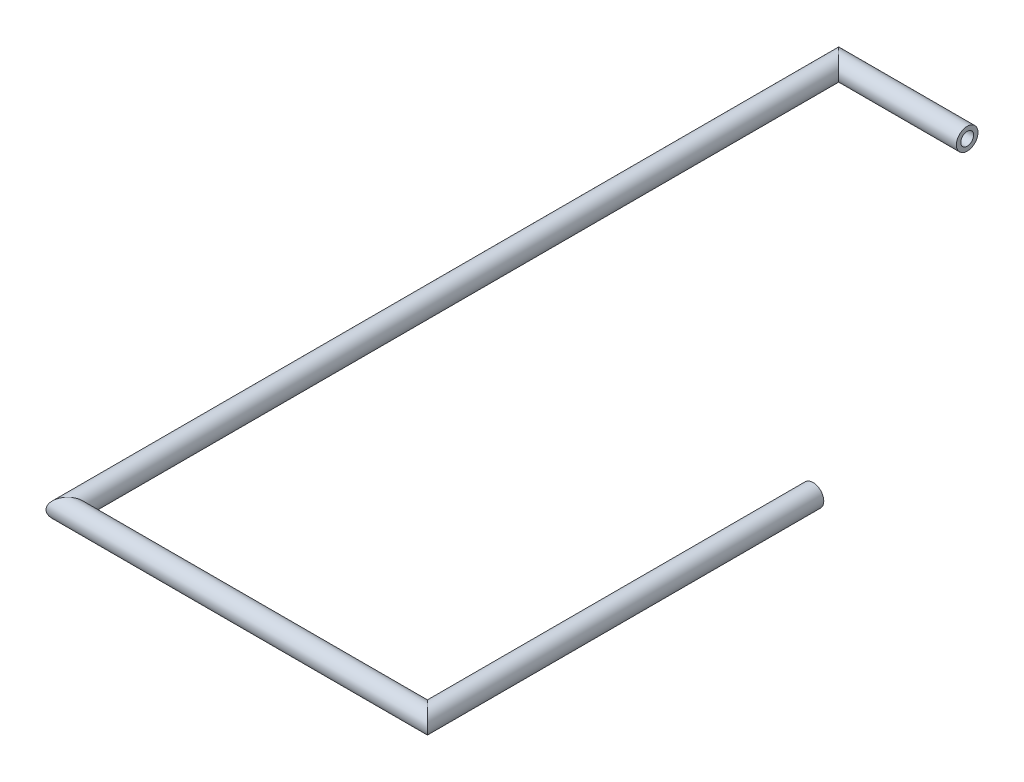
from build123d import *

# Parameters (mm, degrees)
SKETCH3_R   = 10.668
SKETCH3_R_2 = 6.35


with BuildPart() as part:
    # Sweep1: sweep along a path in Sketch2
    with BuildLine(Plane(origin=(0, 2165.865043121, 0), x_dir=(1, 0, 0), z_dir=(0, 1, 0))) as sweep1_path:
        Line((0, 0), (0, -381))
        Line((0, -381), (-355.6, -381))
        Line((-355.6, -381), (-355.6, 381))
        Line((-355.6, 381), (-228.6, 381))
    # Sketch3 → Sweep1 (sweep)
    with BuildSketch(Plane.XY):
        with Locations((0, 2165.865043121)):
            Circle(SKETCH3_R)
        with Locations((0, 2165.865043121)):
            Circle(SKETCH3_R_2, mode=Mode.SUBTRACT)
    sweep(path=sweep1_path.line, transition=Transition.RIGHT)


solid = part.part
